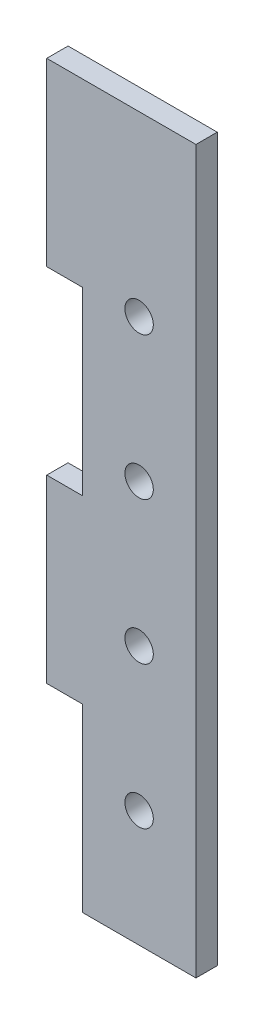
from build123d import *

# Parameters (mm, degrees)
SKETCH1_W           = 16
SKETCH1_H           = 101.6
SKETCH1_R           = 2
BOSS_EXTRUDE1_DEPTH = 3
SKETCH3_W           = 3
SKETCH3_H           = 25.4
BOSS_EXTRUDE3_DEPTH = 5
SKETCH6_R           = 1
CUT_EXTRUDE3_DEPTH  = 20
SKETCH7_R           = 1
CUT_EXTRUDE4_DEPTH  = 20


with BuildPart() as part:
    # Sketch1 → Boss-Extrude1 (new body)
    with BuildSketch(Plane.XY):
        Rectangle(SKETCH1_W, SKETCH1_H)
        with Locations((0, 25.8)):
            Circle(SKETCH1_R, mode=Mode.SUBTRACT)
        with Locations((0, 5.734)):
            Circle(SKETCH1_R, mode=Mode.SUBTRACT)
        with Locations((0, -14.332)):
            Circle(SKETCH1_R, mode=Mode.SUBTRACT)
        with Locations((0, -34.398)):
            Circle(SKETCH1_R, mode=Mode.SUBTRACT)
    extrude(amount=BOSS_EXTRUDE1_DEPTH)

    # Sketch3 → Boss-Extrude3 (add)
    with BuildSketch(Plane.ZY.offset(8)):
        with Locations((1.5, 38.1)):
            Rectangle(SKETCH3_W, SKETCH3_H)
        with Locations((1.5, -12.7)):
            Rectangle(SKETCH3_W, SKETCH3_H)
    extrude(amount=BOSS_EXTRUDE3_DEPTH)

    # Sketch6 → Cut-Extrude3 (cut)
    with BuildSketch(Plane.XZ.offset(-25.4)):
        with Locations((-10.5, 1.5)):
            Circle(SKETCH6_R)
    extrude(amount=-CUT_EXTRUDE3_DEPTH, mode=Mode.SUBTRACT)

    # Sketch7 → Cut-Extrude4 (cut)
    with BuildSketch(Plane.XZ.offset(25.4)):
        with Locations((-10.5, 1.5)):
            Circle(SKETCH7_R)
    extrude(amount=-CUT_EXTRUDE4_DEPTH, mode=Mode.SUBTRACT)


solid = part.part
